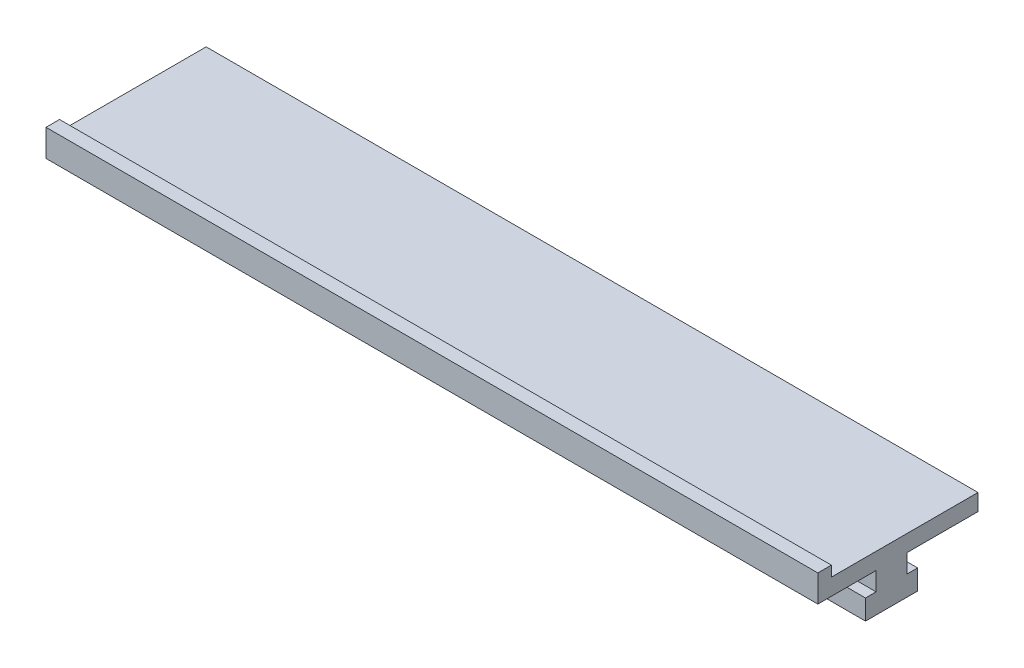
ISO-10303-21;
HEADER;
FILE_DESCRIPTION(('STEP AP214'),'2;1');
FILE_NAME('part.step','',(''),(''),'','','');
FILE_SCHEMA(('AUTOMOTIVE_DESIGN { 1 0 10303 214 1 1 1 1 }'));
ENDSEC;
DATA;
#1=APPLICATION_CONTEXT('core data for automotive mechanical design processes');
#2=APPLICATION_PROTOCOL_DEFINITION('international standard','automotive_design',2000,#1);
#3=PRODUCT_CONTEXT('',#1,'mechanical');
#4=PRODUCT('Part','Part','',(#3));
#5=PRODUCT_RELATED_PRODUCT_CATEGORY('part','',(#4));
#6=PRODUCT_DEFINITION_FORMATION('','',#4);
#7=PRODUCT_DEFINITION_CONTEXT('part definition',#1,'design');
#8=PRODUCT_DEFINITION('design','',#6,#7);
#9=PRODUCT_DEFINITION_SHAPE('','',#8);
#10=(LENGTH_UNIT() NAMED_UNIT(*) SI_UNIT(.MILLI.,.METRE.));
#11=(NAMED_UNIT(*) PLANE_ANGLE_UNIT() SI_UNIT($,.RADIAN.));
#12=(NAMED_UNIT(*) SI_UNIT($,.STERADIAN.) SOLID_ANGLE_UNIT());
#13=UNCERTAINTY_MEASURE_WITH_UNIT(LENGTH_MEASURE(1.E-05),#10,'distance_accuracy_value','');
#14=(GEOMETRIC_REPRESENTATION_CONTEXT(3) GLOBAL_UNCERTAINTY_ASSIGNED_CONTEXT((#13)) GLOBAL_UNIT_ASSIGNED_CONTEXT((#10,
#11,#12)) REPRESENTATION_CONTEXT('',''));
#15=CARTESIAN_POINT('',(0.,0.,0.));
#16=DIRECTION('',(0.,0.,1.));
#17=DIRECTION('',(1.,0.,0.));
#18=AXIS2_PLACEMENT_3D('',#15,#16,#17);
#19=CARTESIAN_POINT('',(200.,0.332093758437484,-22.632843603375));
#20=DIRECTION('',(0.,0.,1.));
#21=DIRECTION('',(1.,0.,0.));
#22=AXIS2_PLACEMENT_3D('',#19,#20,#21);
#23=PLANE('',#22);
#24=DIRECTION('',(0.,1.,0.));
#25=VECTOR('',#24,1.);
#26=CARTESIAN_POINT('',(0.,0.332093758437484,-22.632843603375));
#27=LINE('',#26,#25);
#28=CARTESIAN_POINT('',(0.,0.332093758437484,-22.632843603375));
#29=VERTEX_POINT('',#28);
#30=CARTESIAN_POINT('',(0.,4.63209375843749,-22.632843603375));
#31=VERTEX_POINT('',#30);
#32=EDGE_CURVE('E231',#29,#31,#27,.T.);
#33=ORIENTED_EDGE('',*,*,#32,.T.);
#34=DIRECTION('',(-1.,0.,0.));
#35=VECTOR('',#34,1.);
#36=CARTESIAN_POINT('',(200.,4.63209375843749,-22.632843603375));
#37=LINE('',#36,#35);
#38=CARTESIAN_POINT('',(200.,4.63209375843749,-22.632843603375));
#39=VERTEX_POINT('',#38);
#40=EDGE_CURVE('E13',#39,#31,#37,.T.);
#41=ORIENTED_EDGE('',*,*,#40,.F.);
#42=DIRECTION('',(0.,1.,0.));
#43=VECTOR('',#42,1.);
#44=CARTESIAN_POINT('',(200.,0.332093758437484,-22.632843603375));
#45=LINE('',#44,#43);
#46=CARTESIAN_POINT('',(200.,0.332093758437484,-22.632843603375));
#47=VERTEX_POINT('',#46);
#48=EDGE_CURVE('E271',#47,#39,#45,.T.);
#49=ORIENTED_EDGE('',*,*,#48,.F.);
#50=DIRECTION('',(-1.,0.,0.));
#51=VECTOR('',#50,1.);
#52=CARTESIAN_POINT('',(200.,0.332093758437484,-22.632843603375));
#53=LINE('',#52,#51);
#54=EDGE_CURVE('E227',#47,#29,#53,.T.);
#55=ORIENTED_EDGE('',*,*,#54,.T.);
#56=EDGE_LOOP('',(#33,#41,#49,#55));
#57=FACE_BOUND('',#56,.T.);
#58=ADVANCED_FACE('F94',(#57),#23,.F.);
#59=CARTESIAN_POINT('',(200.,4.63209375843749,-22.632843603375));
#60=DIRECTION('',(0.,-1.,0.));
#61=DIRECTION('',(0.,0.,-1.));
#62=AXIS2_PLACEMENT_3D('',#59,#60,#61);
#63=PLANE('',#62);
#64=DIRECTION('',(0.,0.,1.));
#65=VECTOR('',#64,1.);
#66=CARTESIAN_POINT('',(0.,4.63209375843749,-22.632843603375));
#67=LINE('',#66,#65);
#68=CARTESIAN_POINT('',(0.,4.63209375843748,15.367156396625));
#69=VERTEX_POINT('',#68);
#70=EDGE_CURVE('E235',#31,#69,#67,.T.);
#71=ORIENTED_EDGE('',*,*,#70,.T.);
#72=DIRECTION('',(-1.,0.,0.));
#73=VECTOR('',#72,1.);
#74=CARTESIAN_POINT('',(200.,4.63209375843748,15.367156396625));
#75=LINE('',#74,#73);
#76=CARTESIAN_POINT('',(200.,4.63209375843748,15.367156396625));
#77=VERTEX_POINT('',#76);
#78=EDGE_CURVE('E103',#77,#69,#75,.T.);
#79=ORIENTED_EDGE('',*,*,#78,.F.);
#80=DIRECTION('',(0.,0.,1.));
#81=VECTOR('',#80,1.);
#82=CARTESIAN_POINT('',(200.,4.63209375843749,-22.632843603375));
#83=LINE('',#82,#81);
#84=EDGE_CURVE('E172',#39,#77,#83,.T.);
#85=ORIENTED_EDGE('',*,*,#84,.F.);
#86=ORIENTED_EDGE('',*,*,#40,.T.);
#87=EDGE_LOOP('',(#71,#79,#85,#86));
#88=FACE_BOUND('',#87,.T.);
#89=ADVANCED_FACE('F379',(#88),#63,.F.);
#90=CARTESIAN_POINT('',(200.,4.63209375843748,15.367156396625));
#91=DIRECTION('',(0.,0.,1.));
#92=DIRECTION('',(0.,-1.,0.));
#93=AXIS2_PLACEMENT_3D('',#90,#91,#92);
#94=PLANE('',#93);
#95=DIRECTION('',(0.,1.,0.));
#96=VECTOR('',#95,1.);
#97=CARTESIAN_POINT('',(0.,4.63209375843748,15.367156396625));
#98=LINE('',#97,#96);
#99=CARTESIAN_POINT('',(0.,7.33209375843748,15.367156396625));
#100=VERTEX_POINT('',#99);
#101=EDGE_CURVE('E238',#69,#100,#98,.T.);
#102=ORIENTED_EDGE('',*,*,#101,.T.);
#103=DIRECTION('',(-1.,0.,0.));
#104=VECTOR('',#103,1.);
#105=CARTESIAN_POINT('',(200.,7.33209375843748,15.367156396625));
#106=LINE('',#105,#104);
#107=CARTESIAN_POINT('',(200.,7.33209375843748,15.367156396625));
#108=VERTEX_POINT('',#107);
#109=EDGE_CURVE('E306',#108,#100,#106,.T.);
#110=ORIENTED_EDGE('',*,*,#109,.F.);
#111=DIRECTION('',(0.,1.,0.));
#112=VECTOR('',#111,1.);
#113=CARTESIAN_POINT('',(200.,4.63209375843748,15.367156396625));
#114=LINE('',#113,#112);
#115=EDGE_CURVE('E316',#77,#108,#114,.T.);
#116=ORIENTED_EDGE('',*,*,#115,.F.);
#117=ORIENTED_EDGE('',*,*,#78,.T.);
#118=EDGE_LOOP('',(#102,#110,#116,#117));
#119=FACE_BOUND('',#118,.T.);
#120=ADVANCED_FACE('F314',(#119),#94,.F.);
#121=CARTESIAN_POINT('',(200.,7.33209375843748,15.367156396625));
#122=DIRECTION('',(0.,-1.,0.));
#123=DIRECTION('',(0.,0.,-1.));
#124=AXIS2_PLACEMENT_3D('',#121,#122,#123);
#125=PLANE('',#124);
#126=DIRECTION('',(0.,0.,1.));
#127=VECTOR('',#126,1.);
#128=CARTESIAN_POINT('',(0.,7.33209375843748,15.367156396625));
#129=LINE('',#128,#127);
#130=CARTESIAN_POINT('',(0.,7.33209375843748,18.867156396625));
#131=VERTEX_POINT('',#130);
#132=EDGE_CURVE('E241',#100,#131,#129,.T.);
#133=ORIENTED_EDGE('',*,*,#132,.T.);
#134=DIRECTION('',(-1.,0.,0.));
#135=VECTOR('',#134,1.);
#136=CARTESIAN_POINT('',(200.,7.33209375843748,18.867156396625));
#137=LINE('',#136,#135);
#138=CARTESIAN_POINT('',(200.,7.33209375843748,18.867156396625));
#139=VERTEX_POINT('',#138);
#140=EDGE_CURVE('E302',#139,#131,#137,.T.);
#141=ORIENTED_EDGE('',*,*,#140,.F.);
#142=DIRECTION('',(0.,0.,1.));
#143=VECTOR('',#142,1.);
#144=CARTESIAN_POINT('',(200.,7.33209375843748,15.367156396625));
#145=LINE('',#144,#143);
#146=EDGE_CURVE('E335',#108,#139,#145,.T.);
#147=ORIENTED_EDGE('',*,*,#146,.F.);
#148=ORIENTED_EDGE('',*,*,#109,.T.);
#149=EDGE_LOOP('',(#133,#141,#147,#148));
#150=FACE_BOUND('',#149,.T.);
#151=ADVANCED_FACE('F325',(#150),#125,.F.);
#152=CARTESIAN_POINT('',(200.,7.33209375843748,18.867156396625));
#153=DIRECTION('',(0.,0.,-1.));
#154=DIRECTION('',(-1.,0.,0.));
#155=AXIS2_PLACEMENT_3D('',#152,#153,#154);
#156=PLANE('',#155);
#157=DIRECTION('',(0.,-1.,0.));
#158=VECTOR('',#157,1.);
#159=CARTESIAN_POINT('',(0.,7.33209375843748,18.867156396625));
#160=LINE('',#159,#158);
#161=CARTESIAN_POINT('',(0.,0.332093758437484,18.867156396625));
#162=VERTEX_POINT('',#161);
#163=EDGE_CURVE('E244',#131,#162,#160,.T.);
#164=ORIENTED_EDGE('',*,*,#163,.T.);
#165=DIRECTION('',(-1.,0.,0.));
#166=VECTOR('',#165,1.);
#167=CARTESIAN_POINT('',(200.,0.332093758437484,18.867156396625));
#168=LINE('',#167,#166);
#169=CARTESIAN_POINT('',(200.,0.332093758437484,18.867156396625));
#170=VERTEX_POINT('',#169);
#171=EDGE_CURVE('E298',#170,#162,#168,.T.);
#172=ORIENTED_EDGE('',*,*,#171,.F.);
#173=DIRECTION('',(0.,-1.,0.));
#174=VECTOR('',#173,1.);
#175=CARTESIAN_POINT('',(200.,7.33209375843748,18.867156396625));
#176=LINE('',#175,#174);
#177=EDGE_CURVE('E331',#139,#170,#176,.T.);
#178=ORIENTED_EDGE('',*,*,#177,.F.);
#179=ORIENTED_EDGE('',*,*,#140,.T.);
#180=EDGE_LOOP('',(#164,#172,#178,#179));
#181=FACE_BOUND('',#180,.T.);
#182=ADVANCED_FACE('F329',(#181),#156,.F.);
#183=CARTESIAN_POINT('',(200.,0.332093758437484,18.867156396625));
#184=DIRECTION('',(0.,1.,0.));
#185=DIRECTION('',(0.,0.,1.));
#186=AXIS2_PLACEMENT_3D('',#183,#184,#185);
#187=PLANE('',#186);
#188=DIRECTION('',(0.,0.,-1.));
#189=VECTOR('',#188,1.);
#190=CARTESIAN_POINT('',(0.,0.332093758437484,18.867156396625));
#191=LINE('',#190,#189);
#192=CARTESIAN_POINT('',(0.,0.332093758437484,3.76715639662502));
#193=VERTEX_POINT('',#192);
#194=EDGE_CURVE('E247',#162,#193,#191,.T.);
#195=ORIENTED_EDGE('',*,*,#194,.T.);
#196=DIRECTION('',(-1.,0.,0.));
#197=VECTOR('',#196,1.);
#198=CARTESIAN_POINT('',(200.,0.332093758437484,3.76715639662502));
#199=LINE('',#198,#197);
#200=CARTESIAN_POINT('',(200.,0.332093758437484,3.76715639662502));
#201=VERTEX_POINT('',#200);
#202=EDGE_CURVE('E294',#201,#193,#199,.T.);
#203=ORIENTED_EDGE('',*,*,#202,.F.);
#204=DIRECTION('',(0.,0.,-1.));
#205=VECTOR('',#204,1.);
#206=CARTESIAN_POINT('',(200.,0.332093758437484,18.867156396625));
#207=LINE('',#206,#205);
#208=EDGE_CURVE('E334',#170,#201,#207,.T.);
#209=ORIENTED_EDGE('',*,*,#208,.F.);
#210=ORIENTED_EDGE('',*,*,#171,.T.);
#211=EDGE_LOOP('',(#195,#203,#209,#210));
#212=FACE_BOUND('',#211,.T.);
#213=ADVANCED_FACE('F392',(#212),#187,.F.);
#214=CARTESIAN_POINT('',(200.,0.332093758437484,3.76715639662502));
#215=DIRECTION('',(0.,0.,-1.));
#216=DIRECTION('',(-1.,0.,0.));
#217=AXIS2_PLACEMENT_3D('',#214,#215,#216);
#218=PLANE('',#217);
#219=DIRECTION('',(0.,-1.,0.));
#220=VECTOR('',#219,1.);
#221=CARTESIAN_POINT('',(0.,0.332093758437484,3.76715639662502));
#222=LINE('',#221,#220);
#223=CARTESIAN_POINT('',(0.,-4.46790624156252,3.76715639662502));
#224=VERTEX_POINT('',#223);
#225=EDGE_CURVE('E250',#193,#224,#222,.T.);
#226=ORIENTED_EDGE('',*,*,#225,.T.);
#227=DIRECTION('',(-1.,0.,0.));
#228=VECTOR('',#227,1.);
#229=CARTESIAN_POINT('',(200.,-4.46790624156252,3.76715639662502));
#230=LINE('',#229,#228);
#231=CARTESIAN_POINT('',(200.,-4.46790624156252,3.76715639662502));
#232=VERTEX_POINT('',#231);
#233=EDGE_CURVE('E290',#232,#224,#230,.T.);
#234=ORIENTED_EDGE('',*,*,#233,.F.);
#235=DIRECTION('',(0.,-1.,0.));
#236=VECTOR('',#235,1.);
#237=CARTESIAN_POINT('',(200.,0.332093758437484,3.76715639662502));
#238=LINE('',#237,#236);
#239=EDGE_CURVE('E339',#201,#232,#238,.T.);
#240=ORIENTED_EDGE('',*,*,#239,.F.);
#241=ORIENTED_EDGE('',*,*,#202,.T.);
#242=EDGE_LOOP('',(#226,#234,#240,#241));
#243=FACE_BOUND('',#242,.T.);
#244=ADVANCED_FACE('F395',(#243),#218,.F.);
#245=CARTESIAN_POINT('',(200.,-4.46790624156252,3.76715639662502));
#246=DIRECTION('',(0.,-1.,0.));
#247=DIRECTION('',(0.,0.,-1.));
#248=AXIS2_PLACEMENT_3D('',#245,#246,#247);
#249=PLANE('',#248);
#250=DIRECTION('',(0.,0.,1.));
#251=VECTOR('',#250,1.);
#252=CARTESIAN_POINT('',(0.,-4.46790624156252,3.76715639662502));
#253=LINE('',#252,#251);
#254=CARTESIAN_POINT('',(0.,-4.46790624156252,6.51715639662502));
#255=VERTEX_POINT('',#254);
#256=EDGE_CURVE('E253',#224,#255,#253,.T.);
#257=ORIENTED_EDGE('',*,*,#256,.T.);
#258=DIRECTION('',(-1.,0.,0.));
#259=VECTOR('',#258,1.);
#260=CARTESIAN_POINT('',(200.,-4.46790624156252,6.51715639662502));
#261=LINE('',#260,#259);
#262=CARTESIAN_POINT('',(200.,-4.46790624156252,6.51715639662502));
#263=VERTEX_POINT('',#262);
#264=EDGE_CURVE('E286',#263,#255,#261,.T.);
#265=ORIENTED_EDGE('',*,*,#264,.F.);
#266=DIRECTION('',(0.,0.,1.));
#267=VECTOR('',#266,1.);
#268=CARTESIAN_POINT('',(200.,-4.46790624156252,3.76715639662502));
#269=LINE('',#268,#267);
#270=EDGE_CURVE('E346',#232,#263,#269,.T.);
#271=ORIENTED_EDGE('',*,*,#270,.F.);
#272=ORIENTED_EDGE('',*,*,#233,.T.);
#273=EDGE_LOOP('',(#257,#265,#271,#272));
#274=FACE_BOUND('',#273,.T.);
#275=ADVANCED_FACE('F399',(#274),#249,.F.);
#276=CARTESIAN_POINT('',(200.,-4.46790624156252,6.51715639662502));
#277=DIRECTION('',(0.,0.,-1.));
#278=DIRECTION('',(-1.,0.,0.));
#279=AXIS2_PLACEMENT_3D('',#276,#277,#278);
#280=PLANE('',#279);
#281=DIRECTION('',(0.,-1.,0.));
#282=VECTOR('',#281,1.);
#283=CARTESIAN_POINT('',(0.,-4.46790624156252,6.51715639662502));
#284=LINE('',#283,#282);
#285=CARTESIAN_POINT('',(0.,-9.66790624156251,6.51715639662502));
#286=VERTEX_POINT('',#285);
#287=EDGE_CURVE('E256',#255,#286,#284,.T.);
#288=ORIENTED_EDGE('',*,*,#287,.T.);
#289=DIRECTION('',(-1.,0.,0.));
#290=VECTOR('',#289,1.);
#291=CARTESIAN_POINT('',(200.,-9.66790624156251,6.51715639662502));
#292=LINE('',#291,#290);
#293=CARTESIAN_POINT('',(200.,-9.66790624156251,6.51715639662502));
#294=VERTEX_POINT('',#293);
#295=EDGE_CURVE('E282',#294,#286,#292,.T.);
#296=ORIENTED_EDGE('',*,*,#295,.F.);
#297=DIRECTION('',(0.,-1.,0.));
#298=VECTOR('',#297,1.);
#299=CARTESIAN_POINT('',(200.,-4.46790624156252,6.51715639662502));
#300=LINE('',#299,#298);
#301=EDGE_CURVE('E349',#263,#294,#300,.T.);
#302=ORIENTED_EDGE('',*,*,#301,.F.);
#303=ORIENTED_EDGE('',*,*,#264,.T.);
#304=EDGE_LOOP('',(#288,#296,#302,#303));
#305=FACE_BOUND('',#304,.T.);
#306=ADVANCED_FACE('F403',(#305),#280,.F.);
#307=CARTESIAN_POINT('',(200.,-9.66790624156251,6.51715639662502));
#308=DIRECTION('',(0.,1.,0.));
#309=DIRECTION('',(0.,0.,1.));
#310=AXIS2_PLACEMENT_3D('',#307,#308,#309);
#311=PLANE('',#310);
#312=DIRECTION('',(0.,0.,-1.));
#313=VECTOR('',#312,1.);
#314=CARTESIAN_POINT('',(0.,-9.66790624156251,6.51715639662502));
#315=LINE('',#314,#313);
#316=CARTESIAN_POINT('',(0.,-9.66790624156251,-6.98284360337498));
#317=VERTEX_POINT('',#316);
#318=EDGE_CURVE('E259',#286,#317,#315,.T.);
#319=ORIENTED_EDGE('',*,*,#318,.T.);
#320=DIRECTION('',(-1.,0.,0.));
#321=VECTOR('',#320,1.);
#322=CARTESIAN_POINT('',(200.,-9.66790624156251,-6.98284360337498));
#323=LINE('',#322,#321);
#324=CARTESIAN_POINT('',(200.,-9.66790624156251,-6.98284360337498));
#325=VERTEX_POINT('',#324);
#326=EDGE_CURVE('E278',#325,#317,#323,.T.);
#327=ORIENTED_EDGE('',*,*,#326,.F.);
#328=DIRECTION('',(0.,0.,-1.));
#329=VECTOR('',#328,1.);
#330=CARTESIAN_POINT('',(200.,-9.66790624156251,6.51715639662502));
#331=LINE('',#330,#329);
#332=EDGE_CURVE('E352',#294,#325,#331,.T.);
#333=ORIENTED_EDGE('',*,*,#332,.F.);
#334=ORIENTED_EDGE('',*,*,#295,.T.);
#335=EDGE_LOOP('',(#319,#327,#333,#334));
#336=FACE_BOUND('',#335,.T.);
#337=ADVANCED_FACE('F360',(#336),#311,.F.);
#338=CARTESIAN_POINT('',(200.,-9.66790624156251,-6.98284360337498));
#339=DIRECTION('',(0.,0.,1.));
#340=DIRECTION('',(1.,0.,0.));
#341=AXIS2_PLACEMENT_3D('',#338,#339,#340);
#342=PLANE('',#341);
#343=DIRECTION('',(0.,1.,0.));
#344=VECTOR('',#343,1.);
#345=CARTESIAN_POINT('',(0.,-9.66790624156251,-6.98284360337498));
#346=LINE('',#345,#344);
#347=CARTESIAN_POINT('',(0.,-4.46790624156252,-6.98284360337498));
#348=VERTEX_POINT('',#347);
#349=EDGE_CURVE('E262',#317,#348,#346,.T.);
#350=ORIENTED_EDGE('',*,*,#349,.T.);
#351=DIRECTION('',(-1.,0.,0.));
#352=VECTOR('',#351,1.);
#353=CARTESIAN_POINT('',(200.,-4.46790624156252,-6.98284360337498));
#354=LINE('',#353,#352);
#355=CARTESIAN_POINT('',(200.,-4.46790624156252,-6.98284360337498));
#356=VERTEX_POINT('',#355);
#357=EDGE_CURVE('E220',#356,#348,#354,.T.);
#358=ORIENTED_EDGE('',*,*,#357,.F.);
#359=DIRECTION('',(0.,1.,0.));
#360=VECTOR('',#359,1.);
#361=CARTESIAN_POINT('',(200.,-9.66790624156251,-6.98284360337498));
#362=LINE('',#361,#360);
#363=EDGE_CURVE('E209',#325,#356,#362,.T.);
#364=ORIENTED_EDGE('',*,*,#363,.F.);
#365=ORIENTED_EDGE('',*,*,#326,.T.);
#366=EDGE_LOOP('',(#350,#358,#364,#365));
#367=FACE_BOUND('',#366,.T.);
#368=ADVANCED_FACE('F364',(#367),#342,.F.);
#369=CARTESIAN_POINT('',(200.,-4.46790624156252,-6.98284360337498));
#370=DIRECTION('',(0.,-1.,0.));
#371=DIRECTION('',(0.,0.,-1.));
#372=AXIS2_PLACEMENT_3D('',#369,#370,#371);
#373=PLANE('',#372);
#374=DIRECTION('',(0.,0.,1.));
#375=VECTOR('',#374,1.);
#376=CARTESIAN_POINT('',(0.,-4.46790624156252,-6.98284360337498));
#377=LINE('',#376,#375);
#378=CARTESIAN_POINT('',(0.,-4.46790624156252,-4.23284360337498));
#379=VERTEX_POINT('',#378);
#380=EDGE_CURVE('E218',#348,#379,#377,.T.);
#381=ORIENTED_EDGE('',*,*,#380,.T.);
#382=DIRECTION('',(-1.,0.,0.));
#383=VECTOR('',#382,1.);
#384=CARTESIAN_POINT('',(200.,-4.46790624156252,-4.23284360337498));
#385=LINE('',#384,#383);
#386=CARTESIAN_POINT('',(200.,-4.46790624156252,-4.23284360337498));
#387=VERTEX_POINT('',#386);
#388=EDGE_CURVE('E215',#387,#379,#385,.T.);
#389=ORIENTED_EDGE('',*,*,#388,.F.);
#390=DIRECTION('',(0.,0.,1.));
#391=VECTOR('',#390,1.);
#392=CARTESIAN_POINT('',(200.,-4.46790624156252,-6.98284360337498));
#393=LINE('',#392,#391);
#394=EDGE_CURVE('E203',#356,#387,#393,.T.);
#395=ORIENTED_EDGE('',*,*,#394,.F.);
#396=ORIENTED_EDGE('',*,*,#357,.T.);
#397=EDGE_LOOP('',(#381,#389,#395,#396));
#398=FACE_BOUND('',#397,.T.);
#399=ADVANCED_FACE('F216',(#398),#373,.F.);
#400=CARTESIAN_POINT('',(200.,-4.46790624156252,-4.23284360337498));
#401=DIRECTION('',(0.,0.,1.));
#402=DIRECTION('',(1.,0.,0.));
#403=AXIS2_PLACEMENT_3D('',#400,#401,#402);
#404=PLANE('',#403);
#405=DIRECTION('',(0.,1.,0.));
#406=VECTOR('',#405,1.);
#407=CARTESIAN_POINT('',(0.,-4.46790624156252,-4.23284360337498));
#408=LINE('',#407,#406);
#409=CARTESIAN_POINT('',(0.,0.332093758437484,-4.23284360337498));
#410=VERTEX_POINT('',#409);
#411=EDGE_CURVE('E158',#379,#410,#408,.T.);
#412=ORIENTED_EDGE('',*,*,#411,.T.);
#413=DIRECTION('',(-1.,0.,0.));
#414=VECTOR('',#413,1.);
#415=CARTESIAN_POINT('',(200.,0.332093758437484,-4.23284360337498));
#416=LINE('',#415,#414);
#417=CARTESIAN_POINT('',(200.,0.332093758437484,-4.23284360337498));
#418=VERTEX_POINT('',#417);
#419=EDGE_CURVE('E221',#418,#410,#416,.T.);
#420=ORIENTED_EDGE('',*,*,#419,.F.);
#421=DIRECTION('',(0.,1.,0.));
#422=VECTOR('',#421,1.);
#423=CARTESIAN_POINT('',(200.,-4.46790624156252,-4.23284360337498));
#424=LINE('',#423,#422);
#425=EDGE_CURVE('E207',#387,#418,#424,.T.);
#426=ORIENTED_EDGE('',*,*,#425,.F.);
#427=ORIENTED_EDGE('',*,*,#388,.T.);
#428=EDGE_LOOP('',(#412,#420,#426,#427));
#429=FACE_BOUND('',#428,.T.);
#430=ADVANCED_FACE('F223',(#429),#404,.F.);
#431=CARTESIAN_POINT('',(200.,0.332093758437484,-4.23284360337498));
#432=DIRECTION('',(0.,1.,0.));
#433=DIRECTION('',(0.,0.,1.));
#434=AXIS2_PLACEMENT_3D('',#431,#432,#433);
#435=PLANE('',#434);
#436=DIRECTION('',(0.,0.,-1.));
#437=VECTOR('',#436,1.);
#438=CARTESIAN_POINT('',(0.,0.332093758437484,-4.23284360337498));
#439=LINE('',#438,#437);
#440=EDGE_CURVE('E164',#410,#29,#439,.T.);
#441=ORIENTED_EDGE('',*,*,#440,.T.);
#442=ORIENTED_EDGE('',*,*,#54,.F.);
#443=DIRECTION('',(0.,0.,-1.));
#444=VECTOR('',#443,1.);
#445=CARTESIAN_POINT('',(200.,0.332093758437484,-4.23284360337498));
#446=LINE('',#445,#444);
#447=EDGE_CURVE('E111',#418,#47,#446,.T.);
#448=ORIENTED_EDGE('',*,*,#447,.F.);
#449=ORIENTED_EDGE('',*,*,#419,.T.);
#450=EDGE_LOOP('',(#441,#442,#448,#449));
#451=FACE_BOUND('',#450,.T.);
#452=ADVANCED_FACE('F368',(#451),#435,.F.);
#453=CARTESIAN_POINT('',(200.,0.,0.));
#454=DIRECTION('',(1.,0.,0.));
#455=DIRECTION('',(0.,0.,-1.));
#456=AXIS2_PLACEMENT_3D('',#453,#454,#455);
#457=PLANE('',#456);
#458=ORIENTED_EDGE('',*,*,#48,.T.);
#459=ORIENTED_EDGE('',*,*,#84,.T.);
#460=ORIENTED_EDGE('',*,*,#115,.T.);
#461=ORIENTED_EDGE('',*,*,#146,.T.);
#462=ORIENTED_EDGE('',*,*,#177,.T.);
#463=ORIENTED_EDGE('',*,*,#208,.T.);
#464=ORIENTED_EDGE('',*,*,#239,.T.);
#465=ORIENTED_EDGE('',*,*,#270,.T.);
#466=ORIENTED_EDGE('',*,*,#301,.T.);
#467=ORIENTED_EDGE('',*,*,#332,.T.);
#468=ORIENTED_EDGE('',*,*,#363,.T.);
#469=ORIENTED_EDGE('',*,*,#394,.T.);
#470=ORIENTED_EDGE('',*,*,#425,.T.);
#471=ORIENTED_EDGE('',*,*,#447,.T.);
#472=EDGE_LOOP('',(#458,#459,#460,#461,#462,#463,#464,#465,#466,#467,#468,#469,#470,#471));
#473=FACE_BOUND('',#472,.T.);
#474=ADVANCED_FACE('F205',(#473),#457,.T.);
#475=CARTESIAN_POINT('',(0.,0.,0.));
#476=DIRECTION('',(1.,0.,0.));
#477=DIRECTION('',(0.,0.,-1.));
#478=AXIS2_PLACEMENT_3D('',#475,#476,#477);
#479=PLANE('',#478);
#480=ORIENTED_EDGE('',*,*,#32,.F.);
#481=ORIENTED_EDGE('',*,*,#440,.F.);
#482=ORIENTED_EDGE('',*,*,#411,.F.);
#483=ORIENTED_EDGE('',*,*,#380,.F.);
#484=ORIENTED_EDGE('',*,*,#349,.F.);
#485=ORIENTED_EDGE('',*,*,#318,.F.);
#486=ORIENTED_EDGE('',*,*,#287,.F.);
#487=ORIENTED_EDGE('',*,*,#256,.F.);
#488=ORIENTED_EDGE('',*,*,#225,.F.);
#489=ORIENTED_EDGE('',*,*,#194,.F.);
#490=ORIENTED_EDGE('',*,*,#163,.F.);
#491=ORIENTED_EDGE('',*,*,#132,.F.);
#492=ORIENTED_EDGE('',*,*,#101,.F.);
#493=ORIENTED_EDGE('',*,*,#70,.F.);
#494=EDGE_LOOP('',(#480,#481,#482,#483,#484,#485,#486,#487,#488,#489,#490,#491,#492,#493));
#495=FACE_BOUND('',#494,.T.);
#496=ADVANCED_FACE('F320',(#495),#479,.F.);
#497=CLOSED_SHELL('',(#58,#89,#120,#151,#182,#213,#244,#275,#306,#337,#368,#399,#430,#452,#474,#496));
#498=MANIFOLD_SOLID_BREP('B2',#497);
#499=ADVANCED_BREP_SHAPE_REPRESENTATION('',(#18,#498),#14);
#500=SHAPE_DEFINITION_REPRESENTATION(#9,#499);
ENDSEC;
END-ISO-10303-21;
